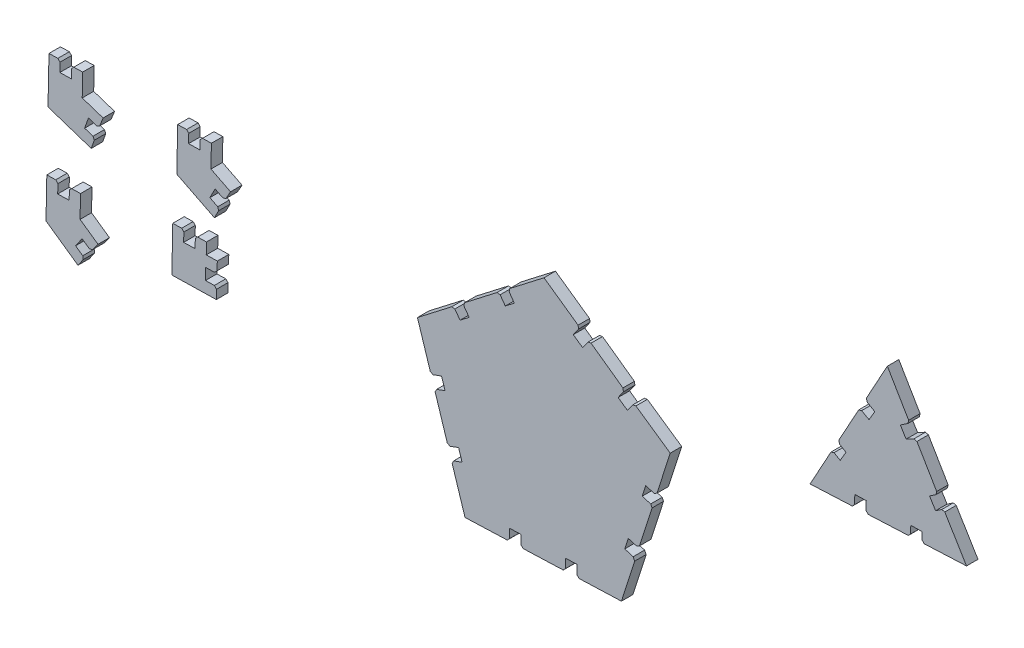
from build123d import *

# Parameters (mm, degrees)
BOSS_EXTRUDE1_DEPTH   = 5
BOSS_EXTRUDE1_2_DEPTH = 5
BOSS_EXTRUDE1_3_DEPTH = 5
BOSS_EXTRUDE1_4_DEPTH = 5
BOSS_EXTRUDE1_5_DEPTH = 5
BOSS_EXTRUDE1_6_DEPTH = 5


with BuildPart() as part:
    # Sketch1 → Boss-Extrude1 (new body)
    with BuildSketch(Plane.XY):
        Polygon((-49.923014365, 4.307633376), (-44.134656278, 22.333414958), (-44.799784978, 23.686052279), (-48.484077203, 24.769712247), (-46.955374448, 29.531870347), (-43.271082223, 28.448210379), (-42.045358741, 29.126020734), (-36.559158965, 46.210837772), (-37.181032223, 47.411946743), (-40.865324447, 48.49560671), (-39.336621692, 53.257764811), (-35.652329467, 52.174104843), (-34.426605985, 52.851915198), (-28.638247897, 70.877696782), (-43.62101736, 81.201231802), (-44.977234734, 80.933485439), (-47.274702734, 77.659189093), (-51.362413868, 80.538546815), (-49.064945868, 83.81284316), (-49.272429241, 85.18224497), (-63.181807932, 95.138992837), (-64.538025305, 94.871246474), (-66.835493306, 91.596950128), (-70.923204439, 94.47630785), (-68.625736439, 97.750604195), (-68.833219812, 99.120006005), (-83.688376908, 109.585732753), (-98.657726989, 98.028126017), (-98.879492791, 96.643009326), (-98.08928771, 95.558653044), (-96.635399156, 93.520940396), (-100.574701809, 90.479464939), (-102.839080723, 93.586751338), (-104.193035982, 93.755277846), (-118.380970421, 82.800990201), (-118.602736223, 81.41587351), (-116.338357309, 78.308587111), (-120.297945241, 75.252329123), (-122.562324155, 78.359615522), (-123.916279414, 78.52814203), (-138.885629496, 66.970535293), (-133.28203954, 49.361814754), (-132.06288097, 48.773511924), (-128.365949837, 50.127399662), (-126.842614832, 45.360528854), (-130.539545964, 44.006641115), (-131.16885296, 42.741394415), (-125.857776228, 26.051867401), (-124.638617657, 25.463564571), (-120.941686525, 26.817452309), (-119.41835152, 22.050581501), (-123.115282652, 20.696693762), (-123.744589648, 19.431447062), (-118.140999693, 1.822726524), (-99.70844056, 2.49754547), (-98.733193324, 3.519071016), (-98.712743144, 7.463106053), (-93.711759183, 7.639910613), (-93.732209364, 3.695875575), (-92.767187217, 2.745383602), (-75.296826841, 3.384976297), (-74.321579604, 4.406501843), (-74.301129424, 8.350536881), (-69.300145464, 8.52734144), (-69.320595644, 4.583306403), (-68.355573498, 3.63281443), align=None)
    extrude(amount=BOSS_EXTRUDE1_DEPTH)


with BuildPart() as body_2:
    # Sketch1 → Boss-Extrude1 2 (new body)
    with BuildSketch(Plane.XY):
        Polygon((87.562637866, 114.482712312), (78.947576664, 129.084880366), (77.648181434, 129.426488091), (74.24208578, 127.595021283), (71.694411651, 131.682575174), (74.996681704, 133.892193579), (75.333478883, 135.275642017), (66.046842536, 151.065474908), (56.900842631, 134.419606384), (57.249498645, 133.067991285), (60.569596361, 131.165924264), (58.058386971, 126.843429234), (54.841906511, 128.686134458), (53.530513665, 128.28555287), (44.856881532, 112.49940137), (45.205537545, 111.147786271), (48.007290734, 109.542676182), (45.496081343, 105.220181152), (42.797945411, 106.765929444), (41.486552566, 106.365347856), (32.340552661, 89.719479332), (50.773188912, 90.575514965), (51.763269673, 91.607005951), (51.843037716, 95.552751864), (56.846062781, 95.651852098), (56.768784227, 91.829249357), (57.718980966, 90.887867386), (75.199618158, 91.699690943), (76.189698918, 92.731181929), (76.257013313, 96.060905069), (81.260038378, 96.160005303), (81.195213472, 92.953425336), (82.145410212, 92.012043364), (100.578046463, 92.868078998), (91.088235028, 108.50951485), (89.773897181, 108.788154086), (87.090249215, 106.99246874), (84.439131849, 111.234618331), (87.225840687, 113.099263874), align=None)
    extrude(amount=BOSS_EXTRUDE1_2_DEPTH)


with BuildPart() as body_3:
    # Sketch1 → Boss-Extrude1 3 (new body)
    with BuildSketch(Plane.XY):
        Polygon((-284.887091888, 86.667073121), (-285.086511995, 76.802708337), (-275.980443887, 73.784448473), (-277.467476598, 70.044722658), (-278.712721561, 69.407200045), (-282.355148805, 70.614503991), (-284.033168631, 65.903191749), (-280.390741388, 64.695887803), (-279.81477273, 63.454713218), (-281.153325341, 59.697318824), (-300.002336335, 65.944934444), (-299.589548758, 86.363573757), (-295.709776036, 86.445333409), (-294.759774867, 85.479336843), (-294.839542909, 81.53359093), (-289.836517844, 81.632691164), (-289.756749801, 85.578437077), (-288.76686461, 86.585313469), align=None)
    extrude(amount=BOSS_EXTRUDE1_3_DEPTH)


with BuildPart() as body_4:
    # Sketch1 → Boss-Extrude1 4 (new body)
    with BuildSketch(Plane.XY):
        Polygon((-228.748648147, 87.868704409), (-228.948068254, 78.004339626), (-220.396346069, 73.708132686), (-222.382109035, 70.15842856), (-223.695394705, 69.69984839), (-227.116083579, 71.418331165), (-229.406650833, 66.977326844), (-225.985961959, 65.258844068), (-225.588903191, 63.94102251), (-227.421356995, 60.388219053), (-243.833832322, 68.633504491), (-243.451105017, 87.565205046), (-239.571332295, 87.646964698), (-238.621331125, 86.680968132), (-238.701099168, 82.735222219), (-233.698074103, 82.834322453), (-233.61830606, 86.780068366), (-232.628420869, 87.786944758), align=None)
    extrude(amount=BOSS_EXTRUDE1_4_DEPTH)


with BuildPart() as body_5:
    # Sketch1 → Boss-Extrude1 5 (new body)
    with BuildSketch(Plane.XY):
        Polygon((-285.823966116, 40.324358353), (-286.023386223, 30.459993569), (-278.192459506, 24.969460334), (-280.636407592, 21.693568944), (-281.992172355, 21.422856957), (-285.124543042, 23.619070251), (-287.987952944, 19.52017318), (-284.855582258, 17.323959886), (-284.645161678, 15.955141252), (-286.935850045, 12.676080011), (-300.881560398, 22.453899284), (-300.526422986, 40.020858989), (-296.646650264, 40.102618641), (-295.696649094, 39.136622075), (-295.776417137, 35.190876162), (-290.773392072, 35.289976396), (-290.693624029, 39.23572231), (-289.703738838, 40.242598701), align=None)
    extrude(amount=BOSS_EXTRUDE1_5_DEPTH)


with BuildPart() as body_6:
    # Sketch1 → Boss-Extrude1 6 (new body)
    with BuildSketch(Plane.XY):
        Polygon((-245.598551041, 49.201344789), (-245.997391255, 29.472615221), (-226.598527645, 29.88141348), (-226.518759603, 33.827159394), (-227.468760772, 34.793155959), (-231.348533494, 34.711396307), (-231.250319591, 39.714576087), (-227.370546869, 39.796335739), (-226.380661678, 40.80321213), (-226.146088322, 44.674861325), (-230.995804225, 44.57266176), (-230.896094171, 49.504844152), (-234.775866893, 49.4230845), (-235.765752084, 48.416208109), (-235.845520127, 44.470462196), (-240.848545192, 44.371361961), (-240.76877715, 48.317107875), (-241.718778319, 49.28310444), align=None)
    extrude(amount=BOSS_EXTRUDE1_6_DEPTH)


solid = Compound([part.part, body_2.part, body_3.part, body_4.part, body_5.part, body_6.part])
